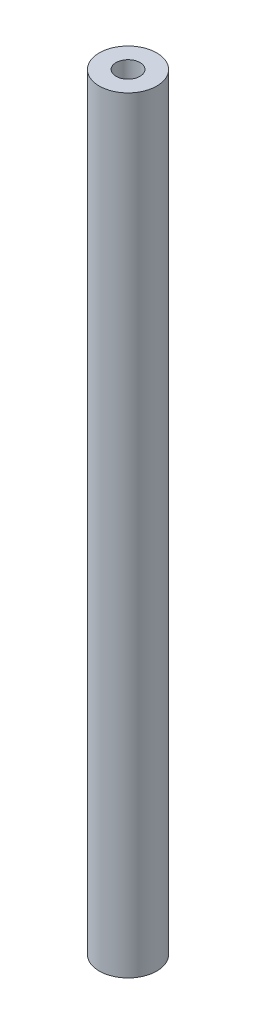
ISO-10303-21;
HEADER;
FILE_DESCRIPTION(('STEP AP214'),'2;1');
FILE_NAME('part.step','',(''),(''),'','','');
FILE_SCHEMA(('AUTOMOTIVE_DESIGN { 1 0 10303 214 1 1 1 1 }'));
ENDSEC;
DATA;
#1=APPLICATION_CONTEXT('core data for automotive mechanical design processes');
#2=APPLICATION_PROTOCOL_DEFINITION('international standard','automotive_design',2000,#1);
#3=PRODUCT_CONTEXT('',#1,'mechanical');
#4=PRODUCT('Part','Part','',(#3));
#5=PRODUCT_RELATED_PRODUCT_CATEGORY('part','',(#4));
#6=PRODUCT_DEFINITION_FORMATION('','',#4);
#7=PRODUCT_DEFINITION_CONTEXT('part definition',#1,'design');
#8=PRODUCT_DEFINITION('design','',#6,#7);
#9=PRODUCT_DEFINITION_SHAPE('','',#8);
#10=(LENGTH_UNIT() NAMED_UNIT(*) SI_UNIT(.MILLI.,.METRE.));
#11=(NAMED_UNIT(*) PLANE_ANGLE_UNIT() SI_UNIT($,.RADIAN.));
#12=(NAMED_UNIT(*) SI_UNIT($,.STERADIAN.) SOLID_ANGLE_UNIT());
#13=UNCERTAINTY_MEASURE_WITH_UNIT(LENGTH_MEASURE(1.E-05),#10,'distance_accuracy_value','');
#14=(GEOMETRIC_REPRESENTATION_CONTEXT(3) GLOBAL_UNCERTAINTY_ASSIGNED_CONTEXT((#13)) GLOBAL_UNIT_ASSIGNED_CONTEXT((#10,
#11,#12)) REPRESENTATION_CONTEXT('',''));
#15=CARTESIAN_POINT('',(0.,0.,0.));
#16=DIRECTION('',(0.,0.,1.));
#17=DIRECTION('',(1.,0.,0.));
#18=AXIS2_PLACEMENT_3D('',#15,#16,#17);
#19=CARTESIAN_POINT('',(0.,72.5000000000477,0.));
#20=DIRECTION('',(0.,1.,0.));
#21=DIRECTION('',(0.,0.,1.));
#22=AXIS2_PLACEMENT_3D('',#19,#20,#21);
#23=CONICAL_SURFACE('',#22,1.25000000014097,1.0297442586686);
#24=CARTESIAN_POINT('',(0.,71.7489242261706,-5.6843418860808E-11));
#25=VERTEX_POINT('',#24);
#26=VERTEX_LOOP('',#25);
#27=FACE_BOUND('',#26,.T.);
#28=CARTESIAN_POINT('',(0.,72.5,0.));
#29=DIRECTION('',(0.,1.,0.));
#30=DIRECTION('',(0.,0.,1.));
#31=AXIS2_PLACEMENT_3D('',#28,#29,#30);
#32=CIRCLE('',#31,1.25);
#33=CARTESIAN_POINT('',(0.,72.5,1.25));
#34=VERTEX_POINT('',#33);
#35=EDGE_CURVE('E37',#34,#34,#32,.T.);
#36=ORIENTED_EDGE('',*,*,#35,.T.);
#37=EDGE_LOOP('',(#36));
#38=FACE_BOUND('',#37,.T.);
#39=ADVANCED_FACE('F17',(#27,#38),#23,.F.);
#40=CARTESIAN_POINT('',(0.,7.50000000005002,0.));
#41=DIRECTION('',(0.,-1.,0.));
#42=DIRECTION('',(1.,0.,0.));
#43=AXIS2_PLACEMENT_3D('',#40,#41,#42);
#44=CONICAL_SURFACE('',#43,1.2499999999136,1.02974425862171);
#45=CARTESIAN_POINT('',(0.,8.25107577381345,2.8421709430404E-11));
#46=VERTEX_POINT('',#45);
#47=VERTEX_LOOP('',#46);
#48=FACE_BOUND('',#47,.T.);
#49=CARTESIAN_POINT('',(0.,7.49999999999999,0.));
#50=DIRECTION('',(0.,-1.,0.));
#51=DIRECTION('',(0.,0.,-1.));
#52=AXIS2_PLACEMENT_3D('',#49,#50,#51);
#53=CIRCLE('',#52,1.24999999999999);
#54=CARTESIAN_POINT('',(0.,7.49999999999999,-1.24999999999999));
#55=VERTEX_POINT('',#54);
#56=EDGE_CURVE('E39',#55,#55,#53,.T.);
#57=ORIENTED_EDGE('',*,*,#56,.T.);
#58=EDGE_LOOP('',(#57));
#59=FACE_BOUND('',#58,.T.);
#60=ADVANCED_FACE('F34',(#48,#59),#44,.F.);
#61=CARTESIAN_POINT('',(0.,80.,0.));
#62=DIRECTION('',(0.,1.,0.));
#63=DIRECTION('',(0.,0.,1.));
#64=AXIS2_PLACEMENT_3D('',#61,#62,#63);
#65=CYLINDRICAL_SURFACE('',#64,1.25);
#66=CARTESIAN_POINT('',(0.,80.,0.));
#67=DIRECTION('',(0.,1.,0.));
#68=DIRECTION('',(0.,0.,1.));
#69=AXIS2_PLACEMENT_3D('',#66,#67,#68);
#70=CIRCLE('',#69,1.25);
#71=CARTESIAN_POINT('',(0.,80.,1.25));
#72=VERTEX_POINT('',#71);
#73=EDGE_CURVE('E20',#72,#72,#70,.F.);
#74=ORIENTED_EDGE('',*,*,#73,.F.);
#75=EDGE_LOOP('',(#74));
#76=FACE_BOUND('',#75,.T.);
#77=ORIENTED_EDGE('',*,*,#35,.F.);
#78=EDGE_LOOP('',(#77));
#79=FACE_BOUND('',#78,.T.);
#80=ADVANCED_FACE('F54',(#76,#79),#65,.F.);
#81=CARTESIAN_POINT('',(0.,0.,0.));
#82=DIRECTION('',(0.,-1.,0.));
#83=DIRECTION('',(0.,0.,-1.));
#84=AXIS2_PLACEMENT_3D('',#81,#82,#83);
#85=CYLINDRICAL_SURFACE('',#84,1.24999999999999);
#86=ORIENTED_EDGE('',*,*,#56,.F.);
#87=EDGE_LOOP('',(#86));
#88=FACE_BOUND('',#87,.T.);
#89=CARTESIAN_POINT('',(0.,0.,0.));
#90=DIRECTION('',(0.,-1.,0.));
#91=DIRECTION('',(0.,0.,-1.));
#92=AXIS2_PLACEMENT_3D('',#89,#90,#91);
#93=CIRCLE('',#92,1.24999999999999);
#94=CARTESIAN_POINT('',(0.,0.,-1.24999999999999));
#95=VERTEX_POINT('',#94);
#96=EDGE_CURVE('E45',#95,#95,#93,.T.);
#97=ORIENTED_EDGE('',*,*,#96,.T.);
#98=EDGE_LOOP('',(#97));
#99=FACE_BOUND('',#98,.T.);
#100=ADVANCED_FACE('F56',(#88,#99),#85,.F.);
#101=CARTESIAN_POINT('',(0.,80.,0.));
#102=DIRECTION('',(0.,1.,0.));
#103=DIRECTION('',(0.,0.,1.));
#104=AXIS2_PLACEMENT_3D('',#101,#102,#103);
#105=PLANE('',#104);
#106=CARTESIAN_POINT('',(0.,80.,0.));
#107=DIRECTION('',(0.,-1.,0.));
#108=DIRECTION('',(0.,0.,-1.));
#109=AXIS2_PLACEMENT_3D('',#106,#107,#108);
#110=CIRCLE('',#109,3.);
#111=CARTESIAN_POINT('',(0.,80.,-3.));
#112=VERTEX_POINT('',#111);
#113=EDGE_CURVE('E26',#112,#112,#110,.T.);
#114=ORIENTED_EDGE('',*,*,#113,.F.);
#115=EDGE_LOOP('',(#114));
#116=FACE_BOUND('',#115,.T.);
#117=ORIENTED_EDGE('',*,*,#73,.T.);
#118=EDGE_LOOP('',(#117));
#119=FACE_BOUND('',#118,.T.);
#120=ADVANCED_FACE('F52',(#116,#119),#105,.T.);
#121=CARTESIAN_POINT('',(0.,0.,0.));
#122=DIRECTION('',(0.,1.,0.));
#123=DIRECTION('',(0.,0.,1.));
#124=AXIS2_PLACEMENT_3D('',#121,#122,#123);
#125=PLANE('',#124);
#126=CARTESIAN_POINT('',(0.,0.,0.));
#127=DIRECTION('',(0.,-1.,0.));
#128=DIRECTION('',(0.,0.,-1.));
#129=AXIS2_PLACEMENT_3D('',#126,#127,#128);
#130=CIRCLE('',#129,3.);
#131=CARTESIAN_POINT('',(0.,0.,-3.));
#132=VERTEX_POINT('',#131);
#133=EDGE_CURVE('E11',#132,#132,#130,.F.);
#134=ORIENTED_EDGE('',*,*,#133,.F.);
#135=EDGE_LOOP('',(#134));
#136=FACE_BOUND('',#135,.T.);
#137=ORIENTED_EDGE('',*,*,#96,.F.);
#138=EDGE_LOOP('',(#137));
#139=FACE_BOUND('',#138,.T.);
#140=ADVANCED_FACE('F67',(#136,#139),#125,.F.);
#141=CARTESIAN_POINT('',(0.,80.,0.));
#142=DIRECTION('',(0.,-1.,0.));
#143=DIRECTION('',(0.,0.,-1.));
#144=AXIS2_PLACEMENT_3D('',#141,#142,#143);
#145=CYLINDRICAL_SURFACE('',#144,3.);
#146=ORIENTED_EDGE('',*,*,#133,.T.);
#147=EDGE_LOOP('',(#146));
#148=FACE_BOUND('',#147,.T.);
#149=ORIENTED_EDGE('',*,*,#113,.T.);
#150=EDGE_LOOP('',(#149));
#151=FACE_BOUND('',#150,.T.);
#152=ADVANCED_FACE('F65',(#148,#151),#145,.T.);
#153=CLOSED_SHELL('',(#39,#60,#80,#100,#120,#140,#152));
#154=MANIFOLD_SOLID_BREP('B1',#153);
#155=ADVANCED_BREP_SHAPE_REPRESENTATION('',(#18,#154),#14);
#156=SHAPE_DEFINITION_REPRESENTATION(#9,#155);
ENDSEC;
END-ISO-10303-21;
